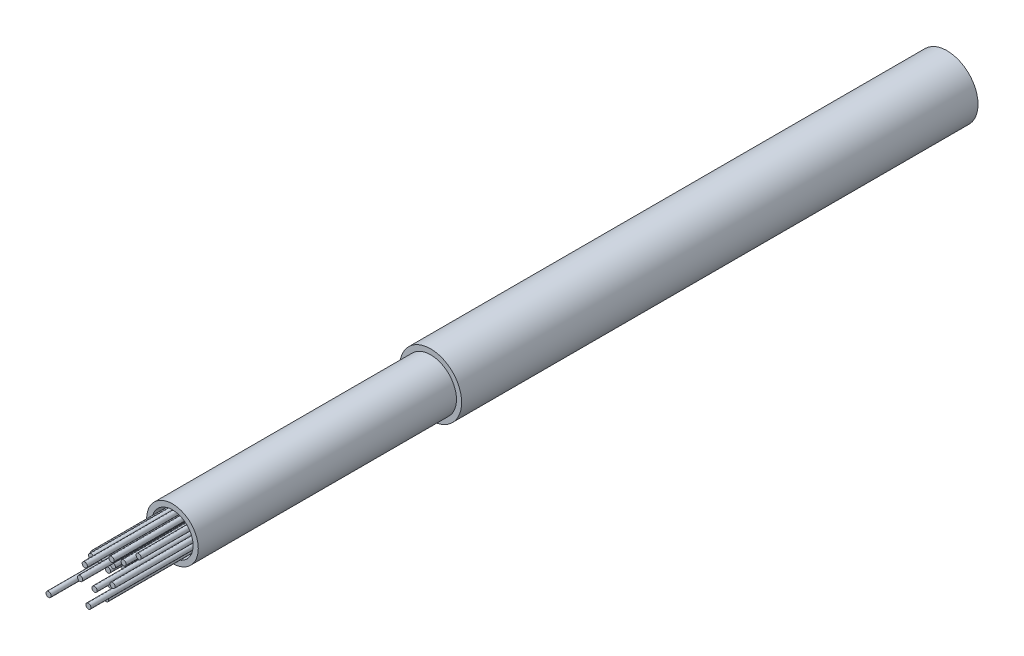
ISO-10303-21;
HEADER;
FILE_DESCRIPTION(('STEP AP214'),'2;1');
FILE_NAME('part.step','',(''),(''),'','','');
FILE_SCHEMA(('AUTOMOTIVE_DESIGN { 1 0 10303 214 1 1 1 1 }'));
ENDSEC;
DATA;
#1=APPLICATION_CONTEXT('core data for automotive mechanical design processes');
#2=APPLICATION_PROTOCOL_DEFINITION('international standard','automotive_design',2000,#1);
#3=PRODUCT_CONTEXT('',#1,'mechanical');
#4=PRODUCT('Part','Part','',(#3));
#5=PRODUCT_RELATED_PRODUCT_CATEGORY('part','',(#4));
#6=PRODUCT_DEFINITION_FORMATION('','',#4);
#7=PRODUCT_DEFINITION_CONTEXT('part definition',#1,'design');
#8=PRODUCT_DEFINITION('design','',#6,#7);
#9=PRODUCT_DEFINITION_SHAPE('','',#8);
#10=(LENGTH_UNIT() NAMED_UNIT(*) SI_UNIT(.MILLI.,.METRE.));
#11=(NAMED_UNIT(*) PLANE_ANGLE_UNIT() SI_UNIT($,.RADIAN.));
#12=(NAMED_UNIT(*) SI_UNIT($,.STERADIAN.) SOLID_ANGLE_UNIT());
#13=UNCERTAINTY_MEASURE_WITH_UNIT(LENGTH_MEASURE(1.E-05),#10,'distance_accuracy_value','');
#14=(GEOMETRIC_REPRESENTATION_CONTEXT(3) GLOBAL_UNCERTAINTY_ASSIGNED_CONTEXT((#13)) GLOBAL_UNIT_ASSIGNED_CONTEXT((#10,
#11,#12)) REPRESENTATION_CONTEXT('',''));
#15=CARTESIAN_POINT('',(0.,0.,0.));
#16=DIRECTION('',(0.,0.,1.));
#17=DIRECTION('',(1.,0.,0.));
#18=AXIS2_PLACEMENT_3D('',#15,#16,#17);
#19=CARTESIAN_POINT('',(12.4859510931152,5.46482605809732,85.4642796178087));
#20=DIRECTION('',(0.,0.,-1.));
#21=DIRECTION('',(-1.,0.,0.));
#22=AXIS2_PLACEMENT_3D('',#19,#20,#21);
#23=CYLINDRICAL_SURFACE('',#22,0.254000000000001);
#24=CARTESIAN_POINT('',(12.4859510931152,5.46482605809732,85.4642796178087));
#25=DIRECTION('',(0.,0.,1.));
#26=DIRECTION('',(1.,0.,0.));
#27=AXIS2_PLACEMENT_3D('',#24,#25,#26);
#28=CIRCLE('',#27,0.254000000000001);
#29=CARTESIAN_POINT('',(12.7399510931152,5.46482605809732,85.4642796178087));
#30=VERTEX_POINT('',#29);
#31=EDGE_CURVE('P0_E10',#30,#30,#28,.T.);
#32=ORIENTED_EDGE('',*,*,#31,.F.);
#33=EDGE_LOOP('',(#32));
#34=FACE_BOUND('',#33,.T.);
#35=CARTESIAN_POINT('',(12.4859510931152,5.46482605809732,34.6642796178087));
#36=DIRECTION('',(0.,0.,1.));
#37=DIRECTION('',(1.,0.,0.));
#38=AXIS2_PLACEMENT_3D('',#35,#36,#37);
#39=CIRCLE('',#38,0.254000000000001);
#40=CARTESIAN_POINT('',(12.7399510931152,5.46482605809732,34.6642796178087));
#41=VERTEX_POINT('',#40);
#42=EDGE_CURVE('P0_E17',#41,#41,#39,.T.);
#43=ORIENTED_EDGE('',*,*,#42,.T.);
#44=EDGE_LOOP('',(#43));
#45=FACE_BOUND('',#44,.T.);
#46=ADVANCED_FACE('P0_F14',(#34,#45),#23,.T.);
#47=CARTESIAN_POINT('',(12.4859510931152,5.46482605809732,85.4642796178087));
#48=DIRECTION('',(0.,0.,1.));
#49=DIRECTION('',(1.,0.,0.));
#50=AXIS2_PLACEMENT_3D('',#47,#48,#49);
#51=PLANE('',#50);
#52=ORIENTED_EDGE('',*,*,#31,.T.);
#53=EDGE_LOOP('',(#52));
#54=FACE_BOUND('',#53,.T.);
#55=ADVANCED_FACE('P0_F29',(#54),#51,.T.);
#56=CARTESIAN_POINT('',(12.4859510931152,5.46482605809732,34.6642796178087));
#57=DIRECTION('',(0.,0.,1.));
#58=DIRECTION('',(1.,0.,0.));
#59=AXIS2_PLACEMENT_3D('',#56,#57,#58);
#60=PLANE('',#59);
#61=ORIENTED_EDGE('',*,*,#42,.F.);
#62=EDGE_LOOP('',(#61));
#63=FACE_BOUND('',#62,.T.);
#64=ADVANCED_FACE('P0_F27',(#63),#60,.F.);
#65=CLOSED_SHELL('',(#46,#55,#64));
#66=MANIFOLD_SOLID_BREP('P0_B1',#65);
#67=CARTESIAN_POINT('',(10.9367534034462,6.18195374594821,81.5129893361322));
#68=DIRECTION('',(0.,0.,-1.));
#69=DIRECTION('',(-1.,0.,0.));
#70=AXIS2_PLACEMENT_3D('',#67,#68,#69);
#71=CYLINDRICAL_SURFACE('',#70,0.254000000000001);
#72=CARTESIAN_POINT('',(10.9367534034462,6.18195374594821,81.5129893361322));
#73=DIRECTION('',(0.,0.,1.));
#74=DIRECTION('',(1.,0.,0.));
#75=AXIS2_PLACEMENT_3D('',#72,#73,#74);
#76=CIRCLE('',#75,0.254000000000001);
#77=CARTESIAN_POINT('',(11.1907534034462,6.18195374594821,81.5129893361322));
#78=VERTEX_POINT('',#77);
#79=EDGE_CURVE('P1_E10',#78,#78,#76,.T.);
#80=ORIENTED_EDGE('',*,*,#79,.F.);
#81=EDGE_LOOP('',(#80));
#82=FACE_BOUND('',#81,.T.);
#83=CARTESIAN_POINT('',(10.9367534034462,6.18195374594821,30.7129893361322));
#84=DIRECTION('',(0.,0.,1.));
#85=DIRECTION('',(1.,0.,0.));
#86=AXIS2_PLACEMENT_3D('',#83,#84,#85);
#87=CIRCLE('',#86,0.254000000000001);
#88=CARTESIAN_POINT('',(11.1907534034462,6.18195374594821,30.7129893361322));
#89=VERTEX_POINT('',#88);
#90=EDGE_CURVE('P1_E17',#89,#89,#87,.T.);
#91=ORIENTED_EDGE('',*,*,#90,.T.);
#92=EDGE_LOOP('',(#91));
#93=FACE_BOUND('',#92,.T.);
#94=ADVANCED_FACE('P1_F14',(#82,#93),#71,.T.);
#95=CARTESIAN_POINT('',(10.9367534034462,6.18195374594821,81.5129893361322));
#96=DIRECTION('',(0.,0.,1.));
#97=DIRECTION('',(1.,0.,0.));
#98=AXIS2_PLACEMENT_3D('',#95,#96,#97);
#99=PLANE('',#98);
#100=ORIENTED_EDGE('',*,*,#79,.T.);
#101=EDGE_LOOP('',(#100));
#102=FACE_BOUND('',#101,.T.);
#103=ADVANCED_FACE('P1_F29',(#102),#99,.T.);
#104=CARTESIAN_POINT('',(10.9367534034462,6.18195374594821,30.7129893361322));
#105=DIRECTION('',(0.,0.,1.));
#106=DIRECTION('',(1.,0.,0.));
#107=AXIS2_PLACEMENT_3D('',#104,#105,#106);
#108=PLANE('',#107);
#109=ORIENTED_EDGE('',*,*,#90,.F.);
#110=EDGE_LOOP('',(#109));
#111=FACE_BOUND('',#110,.T.);
#112=ADVANCED_FACE('P1_F27',(#111),#108,.F.);
#113=CLOSED_SHELL('',(#94,#103,#112));
#114=MANIFOLD_SOLID_BREP('P1_B1',#113);
#115=CARTESIAN_POINT('',(11.1663042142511,6.91034505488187,84.9608276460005));
#116=DIRECTION('',(0.,0.,-1.));
#117=DIRECTION('',(-1.,0.,0.));
#118=AXIS2_PLACEMENT_3D('',#115,#116,#117);
#119=CYLINDRICAL_SURFACE('',#118,0.254000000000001);
#120=CARTESIAN_POINT('',(11.1663042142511,6.91034505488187,84.9608276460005));
#121=DIRECTION('',(0.,0.,1.));
#122=DIRECTION('',(1.,0.,0.));
#123=AXIS2_PLACEMENT_3D('',#120,#121,#122);
#124=CIRCLE('',#123,0.254000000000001);
#125=CARTESIAN_POINT('',(11.4203042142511,6.91034505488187,84.9608276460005));
#126=VERTEX_POINT('',#125);
#127=EDGE_CURVE('P2_E10',#126,#126,#124,.T.);
#128=ORIENTED_EDGE('',*,*,#127,.F.);
#129=EDGE_LOOP('',(#128));
#130=FACE_BOUND('',#129,.T.);
#131=CARTESIAN_POINT('',(11.1663042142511,6.91034505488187,34.1608276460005));
#132=DIRECTION('',(0.,0.,1.));
#133=DIRECTION('',(1.,0.,0.));
#134=AXIS2_PLACEMENT_3D('',#131,#132,#133);
#135=CIRCLE('',#134,0.254000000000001);
#136=CARTESIAN_POINT('',(11.4203042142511,6.91034505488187,34.1608276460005));
#137=VERTEX_POINT('',#136);
#138=EDGE_CURVE('P2_E17',#137,#137,#135,.T.);
#139=ORIENTED_EDGE('',*,*,#138,.T.);
#140=EDGE_LOOP('',(#139));
#141=FACE_BOUND('',#140,.T.);
#142=ADVANCED_FACE('P2_F14',(#130,#141),#119,.T.);
#143=CARTESIAN_POINT('',(11.1663042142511,6.91034505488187,84.9608276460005));
#144=DIRECTION('',(0.,0.,1.));
#145=DIRECTION('',(1.,0.,0.));
#146=AXIS2_PLACEMENT_3D('',#143,#144,#145);
#147=PLANE('',#146);
#148=ORIENTED_EDGE('',*,*,#127,.T.);
#149=EDGE_LOOP('',(#148));
#150=FACE_BOUND('',#149,.T.);
#151=ADVANCED_FACE('P2_F29',(#150),#147,.T.);
#152=CARTESIAN_POINT('',(11.1663042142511,6.91034505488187,34.1608276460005));
#153=DIRECTION('',(0.,0.,1.));
#154=DIRECTION('',(1.,0.,0.));
#155=AXIS2_PLACEMENT_3D('',#152,#153,#154);
#156=PLANE('',#155);
#157=ORIENTED_EDGE('',*,*,#138,.F.);
#158=EDGE_LOOP('',(#157));
#159=FACE_BOUND('',#158,.T.);
#160=ADVANCED_FACE('P2_F27',(#159),#156,.F.);
#161=CLOSED_SHELL('',(#142,#151,#160));
#162=MANIFOLD_SOLID_BREP('P2_B1',#161);
#163=CARTESIAN_POINT('',(11.2274149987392,5.64844669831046,68.6372111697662));
#164=DIRECTION('',(0.,0.,-1.));
#165=DIRECTION('',(-1.,0.,0.));
#166=AXIS2_PLACEMENT_3D('',#163,#164,#165);
#167=CYLINDRICAL_SURFACE('',#166,0.254000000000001);
#168=CARTESIAN_POINT('',(11.2274149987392,5.64844669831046,68.6372111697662));
#169=DIRECTION('',(0.,0.,1.));
#170=DIRECTION('',(1.,0.,0.));
#171=AXIS2_PLACEMENT_3D('',#168,#169,#170);
#172=CIRCLE('',#171,0.254000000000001);
#173=CARTESIAN_POINT('',(11.4814149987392,5.64844669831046,68.6372111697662));
#174=VERTEX_POINT('',#173);
#175=EDGE_CURVE('P3_E10',#174,#174,#172,.T.);
#176=ORIENTED_EDGE('',*,*,#175,.F.);
#177=EDGE_LOOP('',(#176));
#178=FACE_BOUND('',#177,.T.);
#179=CARTESIAN_POINT('',(11.2274149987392,5.64844669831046,17.8372111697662));
#180=DIRECTION('',(0.,0.,1.));
#181=DIRECTION('',(1.,0.,0.));
#182=AXIS2_PLACEMENT_3D('',#179,#180,#181);
#183=CIRCLE('',#182,0.254000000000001);
#184=CARTESIAN_POINT('',(11.4814149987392,5.64844669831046,17.8372111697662));
#185=VERTEX_POINT('',#184);
#186=EDGE_CURVE('P3_E17',#185,#185,#183,.T.);
#187=ORIENTED_EDGE('',*,*,#186,.T.);
#188=EDGE_LOOP('',(#187));
#189=FACE_BOUND('',#188,.T.);
#190=ADVANCED_FACE('P3_F14',(#178,#189),#167,.T.);
#191=CARTESIAN_POINT('',(11.2274149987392,5.64844669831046,68.6372111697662));
#192=DIRECTION('',(0.,0.,1.));
#193=DIRECTION('',(1.,0.,0.));
#194=AXIS2_PLACEMENT_3D('',#191,#192,#193);
#195=PLANE('',#194);
#196=ORIENTED_EDGE('',*,*,#175,.T.);
#197=EDGE_LOOP('',(#196));
#198=FACE_BOUND('',#197,.T.);
#199=ADVANCED_FACE('P3_F29',(#198),#195,.T.);
#200=CARTESIAN_POINT('',(11.2274149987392,5.64844669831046,17.8372111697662));
#201=DIRECTION('',(0.,0.,1.));
#202=DIRECTION('',(1.,0.,0.));
#203=AXIS2_PLACEMENT_3D('',#200,#201,#202);
#204=PLANE('',#203);
#205=ORIENTED_EDGE('',*,*,#186,.F.);
#206=EDGE_LOOP('',(#205));
#207=FACE_BOUND('',#206,.T.);
#208=ADVANCED_FACE('P3_F27',(#207),#204,.F.);
#209=CLOSED_SHELL('',(#190,#199,#208));
#210=MANIFOLD_SOLID_BREP('P3_B1',#209);
#211=CARTESIAN_POINT('',(9.56319362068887,6.76365951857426,82.0601210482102));
#212=DIRECTION('',(0.,0.,-1.));
#213=DIRECTION('',(-1.,0.,0.));
#214=AXIS2_PLACEMENT_3D('',#211,#212,#213);
#215=CYLINDRICAL_SURFACE('',#214,0.254000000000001);
#216=CARTESIAN_POINT('',(9.56319362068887,6.76365951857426,82.0601210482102));
#217=DIRECTION('',(0.,0.,1.));
#218=DIRECTION('',(1.,0.,0.));
#219=AXIS2_PLACEMENT_3D('',#216,#217,#218);
#220=CIRCLE('',#219,0.254000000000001);
#221=CARTESIAN_POINT('',(9.81719362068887,6.76365951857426,82.0601210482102));
#222=VERTEX_POINT('',#221);
#223=EDGE_CURVE('P4_E10',#222,#222,#220,.T.);
#224=ORIENTED_EDGE('',*,*,#223,.F.);
#225=EDGE_LOOP('',(#224));
#226=FACE_BOUND('',#225,.T.);
#227=CARTESIAN_POINT('',(9.56319362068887,6.76365951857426,31.2601210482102));
#228=DIRECTION('',(0.,0.,1.));
#229=DIRECTION('',(1.,0.,0.));
#230=AXIS2_PLACEMENT_3D('',#227,#228,#229);
#231=CIRCLE('',#230,0.254000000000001);
#232=CARTESIAN_POINT('',(9.81719362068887,6.76365951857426,31.2601210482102));
#233=VERTEX_POINT('',#232);
#234=EDGE_CURVE('P4_E17',#233,#233,#231,.T.);
#235=ORIENTED_EDGE('',*,*,#234,.T.);
#236=EDGE_LOOP('',(#235));
#237=FACE_BOUND('',#236,.T.);
#238=ADVANCED_FACE('P4_F14',(#226,#237),#215,.T.);
#239=CARTESIAN_POINT('',(9.56319362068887,6.76365951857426,82.0601210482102));
#240=DIRECTION('',(0.,0.,1.));
#241=DIRECTION('',(1.,0.,0.));
#242=AXIS2_PLACEMENT_3D('',#239,#240,#241);
#243=PLANE('',#242);
#244=ORIENTED_EDGE('',*,*,#223,.T.);
#245=EDGE_LOOP('',(#244));
#246=FACE_BOUND('',#245,.T.);
#247=ADVANCED_FACE('P4_F29',(#246),#243,.T.);
#248=CARTESIAN_POINT('',(9.56319362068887,6.76365951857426,31.2601210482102));
#249=DIRECTION('',(0.,0.,1.));
#250=DIRECTION('',(1.,0.,0.));
#251=AXIS2_PLACEMENT_3D('',#248,#249,#250);
#252=PLANE('',#251);
#253=ORIENTED_EDGE('',*,*,#234,.F.);
#254=EDGE_LOOP('',(#253));
#255=FACE_BOUND('',#254,.T.);
#256=ADVANCED_FACE('P4_F27',(#255),#252,.F.);
#257=CLOSED_SHELL('',(#238,#247,#256));
#258=MANIFOLD_SOLID_BREP('P4_B1',#257);
#259=CARTESIAN_POINT('',(10.3791667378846,5.03331315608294,50.3289535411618));
#260=DIRECTION('',(0.,0.,-1.));
#261=DIRECTION('',(-1.,0.,0.));
#262=AXIS2_PLACEMENT_3D('',#259,#260,#261);
#263=CYLINDRICAL_SURFACE('',#262,0.254000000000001);
#264=CARTESIAN_POINT('',(10.3791667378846,5.03331315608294,50.3289535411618));
#265=DIRECTION('',(0.,0.,1.));
#266=DIRECTION('',(1.,0.,0.));
#267=AXIS2_PLACEMENT_3D('',#264,#265,#266);
#268=CIRCLE('',#267,0.254000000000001);
#269=CARTESIAN_POINT('',(10.6331667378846,5.03331315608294,50.3289535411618));
#270=VERTEX_POINT('',#269);
#271=EDGE_CURVE('P5_E10',#270,#270,#268,.T.);
#272=ORIENTED_EDGE('',*,*,#271,.F.);
#273=EDGE_LOOP('',(#272));
#274=FACE_BOUND('',#273,.T.);
#275=CARTESIAN_POINT('',(10.3791667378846,5.03331315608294,-0.471046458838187));
#276=DIRECTION('',(0.,0.,1.));
#277=DIRECTION('',(1.,0.,0.));
#278=AXIS2_PLACEMENT_3D('',#275,#276,#277);
#279=CIRCLE('',#278,0.254000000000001);
#280=CARTESIAN_POINT('',(10.6331667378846,5.03331315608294,-0.471046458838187));
#281=VERTEX_POINT('',#280);
#282=EDGE_CURVE('P5_E17',#281,#281,#279,.T.);
#283=ORIENTED_EDGE('',*,*,#282,.T.);
#284=EDGE_LOOP('',(#283));
#285=FACE_BOUND('',#284,.T.);
#286=ADVANCED_FACE('P5_F14',(#274,#285),#263,.T.);
#287=CARTESIAN_POINT('',(10.3791667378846,5.03331315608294,50.3289535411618));
#288=DIRECTION('',(0.,0.,1.));
#289=DIRECTION('',(1.,0.,0.));
#290=AXIS2_PLACEMENT_3D('',#287,#288,#289);
#291=PLANE('',#290);
#292=ORIENTED_EDGE('',*,*,#271,.T.);
#293=EDGE_LOOP('',(#292));
#294=FACE_BOUND('',#293,.T.);
#295=ADVANCED_FACE('P5_F29',(#294),#291,.T.);
#296=CARTESIAN_POINT('',(10.3791667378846,5.03331315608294,-0.471046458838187));
#297=DIRECTION('',(0.,0.,1.));
#298=DIRECTION('',(1.,0.,0.));
#299=AXIS2_PLACEMENT_3D('',#296,#297,#298);
#300=PLANE('',#299);
#301=ORIENTED_EDGE('',*,*,#282,.F.);
#302=EDGE_LOOP('',(#301));
#303=FACE_BOUND('',#302,.T.);
#304=ADVANCED_FACE('P5_F27',(#303),#300,.F.);
#305=CLOSED_SHELL('',(#286,#295,#304));
#306=MANIFOLD_SOLID_BREP('P5_B1',#305);
#307=CARTESIAN_POINT('',(10.8743096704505,5.89577903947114,50.181404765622));
#308=DIRECTION('',(0.,0.,1.));
#309=DIRECTION('',(1.,0.,0.));
#310=AXIS2_PLACEMENT_3D('',#307,#308,#309);
#311=PLANE('',#310);
#312=CARTESIAN_POINT('',(10.8743096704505,5.89577903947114,50.181404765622));
#313=DIRECTION('',(0.,0.,1.));
#314=DIRECTION('',(1.,0.,0.));
#315=AXIS2_PLACEMENT_3D('',#312,#313,#314);
#316=CIRCLE('',#315,3.048);
#317=CARTESIAN_POINT('',(13.9223096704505,5.89577903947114,50.181404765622));
#318=VERTEX_POINT('',#317);
#319=EDGE_CURVE('P6_E10',#318,#318,#316,.T.);
#320=ORIENTED_EDGE('',*,*,#319,.T.);
#321=EDGE_LOOP('',(#320));
#322=FACE_BOUND('',#321,.T.);
#323=CARTESIAN_POINT('',(10.8743096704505,5.89577903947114,50.181404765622));
#324=DIRECTION('',(0.,0.,1.));
#325=DIRECTION('',(1.,0.,0.));
#326=AXIS2_PLACEMENT_3D('',#323,#324,#325);
#327=CIRCLE('',#326,2.54);
#328=CARTESIAN_POINT('',(13.4143096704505,5.89577903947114,50.181404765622));
#329=VERTEX_POINT('',#328);
#330=EDGE_CURVE('P6_E27',#329,#329,#327,.T.);
#331=ORIENTED_EDGE('',*,*,#330,.F.);
#332=EDGE_LOOP('',(#331));
#333=FACE_BOUND('',#332,.T.);
#334=ADVANCED_FACE('P6_F14',(#322,#333),#311,.T.);
#335=CARTESIAN_POINT('',(10.8743096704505,5.89577903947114,50.181404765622));
#336=DIRECTION('',(0.,0.,-1.));
#337=DIRECTION('',(-1.,0.,0.));
#338=AXIS2_PLACEMENT_3D('',#335,#336,#337);
#339=CYLINDRICAL_SURFACE('',#338,3.048);
#340=ORIENTED_EDGE('',*,*,#319,.F.);
#341=EDGE_LOOP('',(#340));
#342=FACE_BOUND('',#341,.T.);
#343=CARTESIAN_POINT('',(10.8743096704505,5.89577903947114,-0.61859523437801));
#344=DIRECTION('',(0.,0.,1.));
#345=DIRECTION('',(1.,0.,0.));
#346=AXIS2_PLACEMENT_3D('',#343,#344,#345);
#347=CIRCLE('',#346,3.048);
#348=CARTESIAN_POINT('',(13.9223096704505,5.89577903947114,-0.61859523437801));
#349=VERTEX_POINT('',#348);
#350=EDGE_CURVE('P6_E18',#349,#349,#347,.T.);
#351=ORIENTED_EDGE('',*,*,#350,.T.);
#352=EDGE_LOOP('',(#351));
#353=FACE_BOUND('',#352,.T.);
#354=ADVANCED_FACE('P6_F16',(#342,#353),#339,.T.);
#355=CARTESIAN_POINT('',(10.8743096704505,5.89577903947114,-0.61859523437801));
#356=DIRECTION('',(0.,0.,1.));
#357=DIRECTION('',(1.,0.,0.));
#358=AXIS2_PLACEMENT_3D('',#355,#356,#357);
#359=PLANE('',#358);
#360=ORIENTED_EDGE('',*,*,#350,.F.);
#361=EDGE_LOOP('',(#360));
#362=FACE_BOUND('',#361,.T.);
#363=ADVANCED_FACE('P6_F56',(#362),#359,.F.);
#364=CARTESIAN_POINT('',(10.8743096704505,5.89577903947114,75.581404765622));
#365=DIRECTION('',(0.,0.,-1.));
#366=DIRECTION('',(-1.,0.,0.));
#367=AXIS2_PLACEMENT_3D('',#364,#365,#366);
#368=CYLINDRICAL_SURFACE('',#367,2.54);
#369=CARTESIAN_POINT('',(10.8743096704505,5.89577903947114,75.581404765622));
#370=DIRECTION('',(0.,0.,1.));
#371=DIRECTION('',(1.,0.,0.));
#372=AXIS2_PLACEMENT_3D('',#369,#370,#371);
#373=CIRCLE('',#372,2.54);
#374=CARTESIAN_POINT('',(13.4143096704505,5.89577903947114,75.581404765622));
#375=VERTEX_POINT('',#374);
#376=EDGE_CURVE('P6_E25',#375,#375,#373,.T.);
#377=ORIENTED_EDGE('',*,*,#376,.F.);
#378=EDGE_LOOP('',(#377));
#379=FACE_BOUND('',#378,.T.);
#380=ORIENTED_EDGE('',*,*,#330,.T.);
#381=EDGE_LOOP('',(#380));
#382=FACE_BOUND('',#381,.T.);
#383=ADVANCED_FACE('P6_F50',(#379,#382),#368,.T.);
#384=CARTESIAN_POINT('',(10.8743096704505,5.89577903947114,75.581404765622));
#385=DIRECTION('',(0.,0.,1.));
#386=DIRECTION('',(1.,0.,0.));
#387=AXIS2_PLACEMENT_3D('',#384,#385,#386);
#388=PLANE('',#387);
#389=CARTESIAN_POINT('',(10.8743096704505,5.89577903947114,75.581404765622));
#390=DIRECTION('',(0.,0.,1.));
#391=DIRECTION('',(1.,0.,0.));
#392=AXIS2_PLACEMENT_3D('',#389,#390,#391);
#393=CIRCLE('',#392,2.032);
#394=CARTESIAN_POINT('',(12.9063096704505,5.89577903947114,75.581404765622));
#395=VERTEX_POINT('',#394);
#396=EDGE_CURVE('P6_E33',#395,#395,#393,.T.);
#397=ORIENTED_EDGE('',*,*,#396,.F.);
#398=EDGE_LOOP('',(#397));
#399=FACE_BOUND('',#398,.T.);
#400=ORIENTED_EDGE('',*,*,#376,.T.);
#401=EDGE_LOOP('',(#400));
#402=FACE_BOUND('',#401,.T.);
#403=ADVANCED_FACE('P6_F44',(#399,#402),#388,.T.);
#404=CARTESIAN_POINT('',(10.8743096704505,5.89577903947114,24.781404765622));
#405=DIRECTION('',(0.,0.,1.));
#406=DIRECTION('',(1.,0.,0.));
#407=AXIS2_PLACEMENT_3D('',#404,#405,#406);
#408=CYLINDRICAL_SURFACE('',#407,2.032);
#409=CARTESIAN_POINT('',(10.8743096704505,5.89577903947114,24.781404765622));
#410=DIRECTION('',(0.,0.,1.));
#411=DIRECTION('',(1.,0.,0.));
#412=AXIS2_PLACEMENT_3D('',#409,#410,#411);
#413=CIRCLE('',#412,2.032);
#414=CARTESIAN_POINT('',(12.9063096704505,5.89577903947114,24.781404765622));
#415=VERTEX_POINT('',#414);
#416=EDGE_CURVE('P6_E30',#415,#415,#413,.T.);
#417=ORIENTED_EDGE('',*,*,#416,.F.);
#418=EDGE_LOOP('',(#417));
#419=FACE_BOUND('',#418,.T.);
#420=ORIENTED_EDGE('',*,*,#396,.T.);
#421=EDGE_LOOP('',(#420));
#422=FACE_BOUND('',#421,.T.);
#423=ADVANCED_FACE('P6_F41',(#419,#422),#408,.F.);
#424=CARTESIAN_POINT('',(10.8743096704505,5.89577903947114,24.781404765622));
#425=DIRECTION('',(0.,0.,1.));
#426=DIRECTION('',(1.,0.,0.));
#427=AXIS2_PLACEMENT_3D('',#424,#425,#426);
#428=PLANE('',#427);
#429=ORIENTED_EDGE('',*,*,#416,.T.);
#430=EDGE_LOOP('',(#429));
#431=FACE_BOUND('',#430,.T.);
#432=ADVANCED_FACE('P6_F39',(#431),#428,.T.);
#433=CLOSED_SHELL('',(#334,#354,#363,#383,#403,#423,#432));
#434=MANIFOLD_SOLID_BREP('P6_B1',#433);
#435=CARTESIAN_POINT('',(10.1129591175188,6.31036576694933,81.9412370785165));
#436=DIRECTION('',(0.,0.,-1.));
#437=DIRECTION('',(-1.,0.,0.));
#438=AXIS2_PLACEMENT_3D('',#435,#436,#437);
#439=CYLINDRICAL_SURFACE('',#438,0.254000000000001);
#440=CARTESIAN_POINT('',(10.1129591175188,6.31036576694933,81.9412370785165));
#441=DIRECTION('',(0.,0.,1.));
#442=DIRECTION('',(1.,0.,0.));
#443=AXIS2_PLACEMENT_3D('',#440,#441,#442);
#444=CIRCLE('',#443,0.254000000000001);
#445=CARTESIAN_POINT('',(10.3669591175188,6.31036576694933,81.9412370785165));
#446=VERTEX_POINT('',#445);
#447=EDGE_CURVE('P7_E10',#446,#446,#444,.T.);
#448=ORIENTED_EDGE('',*,*,#447,.F.);
#449=EDGE_LOOP('',(#448));
#450=FACE_BOUND('',#449,.T.);
#451=CARTESIAN_POINT('',(10.1129591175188,6.31036576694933,31.1412370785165));
#452=DIRECTION('',(0.,0.,1.));
#453=DIRECTION('',(1.,0.,0.));
#454=AXIS2_PLACEMENT_3D('',#451,#452,#453);
#455=CIRCLE('',#454,0.254000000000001);
#456=CARTESIAN_POINT('',(10.3669591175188,6.31036576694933,31.1412370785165));
#457=VERTEX_POINT('',#456);
#458=EDGE_CURVE('P7_E17',#457,#457,#455,.T.);
#459=ORIENTED_EDGE('',*,*,#458,.T.);
#460=EDGE_LOOP('',(#459));
#461=FACE_BOUND('',#460,.T.);
#462=ADVANCED_FACE('P7_F14',(#450,#461),#439,.T.);
#463=CARTESIAN_POINT('',(10.1129591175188,6.31036576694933,81.9412370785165));
#464=DIRECTION('',(0.,0.,1.));
#465=DIRECTION('',(1.,0.,0.));
#466=AXIS2_PLACEMENT_3D('',#463,#464,#465);
#467=PLANE('',#466);
#468=ORIENTED_EDGE('',*,*,#447,.T.);
#469=EDGE_LOOP('',(#468));
#470=FACE_BOUND('',#469,.T.);
#471=ADVANCED_FACE('P7_F29',(#470),#467,.T.);
#472=CARTESIAN_POINT('',(10.1129591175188,6.31036576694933,31.1412370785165));
#473=DIRECTION('',(0.,0.,1.));
#474=DIRECTION('',(1.,0.,0.));
#475=AXIS2_PLACEMENT_3D('',#472,#473,#474);
#476=PLANE('',#475);
#477=ORIENTED_EDGE('',*,*,#458,.F.);
#478=EDGE_LOOP('',(#477));
#479=FACE_BOUND('',#478,.T.);
#480=ADVANCED_FACE('P7_F27',(#479),#476,.F.);
#481=CLOSED_SHELL('',(#462,#471,#480));
#482=MANIFOLD_SOLID_BREP('P7_B1',#481);
#483=CARTESIAN_POINT('',(10.5347974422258,6.73247955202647,81.2547410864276));
#484=DIRECTION('',(0.,0.,-1.));
#485=DIRECTION('',(-1.,0.,0.));
#486=AXIS2_PLACEMENT_3D('',#483,#484,#485);
#487=CYLINDRICAL_SURFACE('',#486,0.254000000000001);
#488=CARTESIAN_POINT('',(10.5347974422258,6.73247955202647,81.2547410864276));
#489=DIRECTION('',(0.,0.,1.));
#490=DIRECTION('',(1.,0.,0.));
#491=AXIS2_PLACEMENT_3D('',#488,#489,#490);
#492=CIRCLE('',#491,0.254000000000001);
#493=CARTESIAN_POINT('',(10.7887974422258,6.73247955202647,81.2547410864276));
#494=VERTEX_POINT('',#493);
#495=EDGE_CURVE('P8_E10',#494,#494,#492,.T.);
#496=ORIENTED_EDGE('',*,*,#495,.F.);
#497=EDGE_LOOP('',(#496));
#498=FACE_BOUND('',#497,.T.);
#499=CARTESIAN_POINT('',(10.5347974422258,6.73247955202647,30.4547410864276));
#500=DIRECTION('',(0.,0.,1.));
#501=DIRECTION('',(1.,0.,0.));
#502=AXIS2_PLACEMENT_3D('',#499,#500,#501);
#503=CIRCLE('',#502,0.254000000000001);
#504=CARTESIAN_POINT('',(10.7887974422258,6.73247955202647,30.4547410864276));
#505=VERTEX_POINT('',#504);
#506=EDGE_CURVE('P8_E17',#505,#505,#503,.T.);
#507=ORIENTED_EDGE('',*,*,#506,.T.);
#508=EDGE_LOOP('',(#507));
#509=FACE_BOUND('',#508,.T.);
#510=ADVANCED_FACE('P8_F14',(#498,#509),#487,.T.);
#511=CARTESIAN_POINT('',(10.5347974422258,6.73247955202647,81.2547410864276));
#512=DIRECTION('',(0.,0.,1.));
#513=DIRECTION('',(1.,0.,0.));
#514=AXIS2_PLACEMENT_3D('',#511,#512,#513);
#515=PLANE('',#514);
#516=ORIENTED_EDGE('',*,*,#495,.T.);
#517=EDGE_LOOP('',(#516));
#518=FACE_BOUND('',#517,.T.);
#519=ADVANCED_FACE('P8_F29',(#518),#515,.T.);
#520=CARTESIAN_POINT('',(10.5347974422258,6.73247955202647,30.4547410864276));
#521=DIRECTION('',(0.,0.,1.));
#522=DIRECTION('',(1.,0.,0.));
#523=AXIS2_PLACEMENT_3D('',#520,#521,#522);
#524=PLANE('',#523);
#525=ORIENTED_EDGE('',*,*,#506,.F.);
#526=EDGE_LOOP('',(#525));
#527=FACE_BOUND('',#526,.T.);
#528=ADVANCED_FACE('P8_F27',(#527),#524,.F.);
#529=CLOSED_SHELL('',(#510,#519,#528));
#530=MANIFOLD_SOLID_BREP('P8_B1',#529);
#531=CARTESIAN_POINT('',(10.5515178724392,5.64599425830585,81.6053310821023));
#532=DIRECTION('',(0.,0.,-1.));
#533=DIRECTION('',(-1.,0.,0.));
#534=AXIS2_PLACEMENT_3D('',#531,#532,#533);
#535=CYLINDRICAL_SURFACE('',#534,0.254000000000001);
#536=CARTESIAN_POINT('',(10.5515178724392,5.64599425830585,81.6053310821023));
#537=DIRECTION('',(0.,0.,1.));
#538=DIRECTION('',(1.,0.,0.));
#539=AXIS2_PLACEMENT_3D('',#536,#537,#538);
#540=CIRCLE('',#539,0.254000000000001);
#541=CARTESIAN_POINT('',(10.8055178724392,5.64599425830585,81.6053310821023));
#542=VERTEX_POINT('',#541);
#543=EDGE_CURVE('P9_E10',#542,#542,#540,.T.);
#544=ORIENTED_EDGE('',*,*,#543,.F.);
#545=EDGE_LOOP('',(#544));
#546=FACE_BOUND('',#545,.T.);
#547=CARTESIAN_POINT('',(10.5515178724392,5.64599425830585,30.8053310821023));
#548=DIRECTION('',(0.,0.,1.));
#549=DIRECTION('',(1.,0.,0.));
#550=AXIS2_PLACEMENT_3D('',#547,#548,#549);
#551=CIRCLE('',#550,0.254000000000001);
#552=CARTESIAN_POINT('',(10.8055178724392,5.64599425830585,30.8053310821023));
#553=VERTEX_POINT('',#552);
#554=EDGE_CURVE('P9_E17',#553,#553,#551,.T.);
#555=ORIENTED_EDGE('',*,*,#554,.T.);
#556=EDGE_LOOP('',(#555));
#557=FACE_BOUND('',#556,.T.);
#558=ADVANCED_FACE('P9_F14',(#546,#557),#535,.T.);
#559=CARTESIAN_POINT('',(10.5515178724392,5.64599425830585,81.6053310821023));
#560=DIRECTION('',(0.,0.,1.));
#561=DIRECTION('',(1.,0.,0.));
#562=AXIS2_PLACEMENT_3D('',#559,#560,#561);
#563=PLANE('',#562);
#564=ORIENTED_EDGE('',*,*,#543,.T.);
#565=EDGE_LOOP('',(#564));
#566=FACE_BOUND('',#565,.T.);
#567=ADVANCED_FACE('P9_F29',(#566),#563,.T.);
#568=CARTESIAN_POINT('',(10.5515178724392,5.64599425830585,30.8053310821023));
#569=DIRECTION('',(0.,0.,1.));
#570=DIRECTION('',(1.,0.,0.));
#571=AXIS2_PLACEMENT_3D('',#568,#569,#570);
#572=PLANE('',#571);
#573=ORIENTED_EDGE('',*,*,#554,.F.);
#574=EDGE_LOOP('',(#573));
#575=FACE_BOUND('',#574,.T.);
#576=ADVANCED_FACE('P9_F27',(#575),#572,.F.);
#577=CLOSED_SHELL('',(#558,#567,#576));
#578=MANIFOLD_SOLID_BREP('P9_B1',#577);
#579=CARTESIAN_POINT('',(11.6324856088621,7.47408630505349,82.3367500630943));
#580=DIRECTION('',(0.,0.,-1.));
#581=DIRECTION('',(-1.,0.,0.));
#582=AXIS2_PLACEMENT_3D('',#579,#580,#581);
#583=CYLINDRICAL_SURFACE('',#582,0.254000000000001);
#584=CARTESIAN_POINT('',(11.6324856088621,7.47408630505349,82.3367500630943));
#585=DIRECTION('',(0.,0.,1.));
#586=DIRECTION('',(1.,0.,0.));
#587=AXIS2_PLACEMENT_3D('',#584,#585,#586);
#588=CIRCLE('',#587,0.254000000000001);
#589=CARTESIAN_POINT('',(11.8864856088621,7.47408630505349,82.3367500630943));
#590=VERTEX_POINT('',#589);
#591=EDGE_CURVE('P10_E10',#590,#590,#588,.T.);
#592=ORIENTED_EDGE('',*,*,#591,.F.);
#593=EDGE_LOOP('',(#592));
#594=FACE_BOUND('',#593,.T.);
#595=CARTESIAN_POINT('',(11.6324856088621,7.47408630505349,31.5367500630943));
#596=DIRECTION('',(0.,0.,1.));
#597=DIRECTION('',(1.,0.,0.));
#598=AXIS2_PLACEMENT_3D('',#595,#596,#597);
#599=CIRCLE('',#598,0.254000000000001);
#600=CARTESIAN_POINT('',(11.8864856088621,7.47408630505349,31.5367500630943));
#601=VERTEX_POINT('',#600);
#602=EDGE_CURVE('P10_E17',#601,#601,#599,.T.);
#603=ORIENTED_EDGE('',*,*,#602,.T.);
#604=EDGE_LOOP('',(#603));
#605=FACE_BOUND('',#604,.T.);
#606=ADVANCED_FACE('P10_F14',(#594,#605),#583,.T.);
#607=CARTESIAN_POINT('',(11.6324856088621,7.47408630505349,82.3367500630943));
#608=DIRECTION('',(0.,0.,1.));
#609=DIRECTION('',(1.,0.,0.));
#610=AXIS2_PLACEMENT_3D('',#607,#608,#609);
#611=PLANE('',#610);
#612=ORIENTED_EDGE('',*,*,#591,.T.);
#613=EDGE_LOOP('',(#612));
#614=FACE_BOUND('',#613,.T.);
#615=ADVANCED_FACE('P10_F29',(#614),#611,.T.);
#616=CARTESIAN_POINT('',(11.6324856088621,7.47408630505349,31.5367500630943));
#617=DIRECTION('',(0.,0.,1.));
#618=DIRECTION('',(1.,0.,0.));
#619=AXIS2_PLACEMENT_3D('',#616,#617,#618);
#620=PLANE('',#619);
#621=ORIENTED_EDGE('',*,*,#602,.F.);
#622=EDGE_LOOP('',(#621));
#623=FACE_BOUND('',#622,.T.);
#624=ADVANCED_FACE('P10_F27',(#623),#620,.F.);
#625=CLOSED_SHELL('',(#606,#615,#624));
#626=MANIFOLD_SOLID_BREP('P10_B1',#625);
#627=CARTESIAN_POINT('',(9.40023979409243,5.33199810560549,86.2937508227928));
#628=DIRECTION('',(0.,0.,-1.));
#629=DIRECTION('',(-1.,0.,0.));
#630=AXIS2_PLACEMENT_3D('',#627,#628,#629);
#631=CYLINDRICAL_SURFACE('',#630,0.254000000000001);
#632=CARTESIAN_POINT('',(9.40023979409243,5.33199810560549,86.2937508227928));
#633=DIRECTION('',(0.,0.,1.));
#634=DIRECTION('',(1.,0.,0.));
#635=AXIS2_PLACEMENT_3D('',#632,#633,#634);
#636=CIRCLE('',#635,0.254000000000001);
#637=CARTESIAN_POINT('',(9.65423979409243,5.33199810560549,86.2937508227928));
#638=VERTEX_POINT('',#637);
#639=EDGE_CURVE('P11_E10',#638,#638,#636,.T.);
#640=ORIENTED_EDGE('',*,*,#639,.F.);
#641=EDGE_LOOP('',(#640));
#642=FACE_BOUND('',#641,.T.);
#643=CARTESIAN_POINT('',(9.40023979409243,5.33199810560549,35.4937508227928));
#644=DIRECTION('',(0.,0.,1.));
#645=DIRECTION('',(1.,0.,0.));
#646=AXIS2_PLACEMENT_3D('',#643,#644,#645);
#647=CIRCLE('',#646,0.254000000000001);
#648=CARTESIAN_POINT('',(9.65423979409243,5.33199810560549,35.4937508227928));
#649=VERTEX_POINT('',#648);
#650=EDGE_CURVE('P11_E17',#649,#649,#647,.T.);
#651=ORIENTED_EDGE('',*,*,#650,.T.);
#652=EDGE_LOOP('',(#651));
#653=FACE_BOUND('',#652,.T.);
#654=ADVANCED_FACE('P11_F14',(#642,#653),#631,.T.);
#655=CARTESIAN_POINT('',(9.40023979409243,5.33199810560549,86.2937508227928));
#656=DIRECTION('',(0.,0.,1.));
#657=DIRECTION('',(1.,0.,0.));
#658=AXIS2_PLACEMENT_3D('',#655,#656,#657);
#659=PLANE('',#658);
#660=ORIENTED_EDGE('',*,*,#639,.T.);
#661=EDGE_LOOP('',(#660));
#662=FACE_BOUND('',#661,.T.);
#663=ADVANCED_FACE('P11_F29',(#662),#659,.T.);
#664=CARTESIAN_POINT('',(9.40023979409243,5.33199810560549,35.4937508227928));
#665=DIRECTION('',(0.,0.,1.));
#666=DIRECTION('',(1.,0.,0.));
#667=AXIS2_PLACEMENT_3D('',#664,#665,#666);
#668=PLANE('',#667);
#669=ORIENTED_EDGE('',*,*,#650,.F.);
#670=EDGE_LOOP('',(#669));
#671=FACE_BOUND('',#670,.T.);
#672=ADVANCED_FACE('P11_F27',(#671),#668,.F.);
#673=CLOSED_SHELL('',(#654,#663,#672));
#674=MANIFOLD_SOLID_BREP('P11_B1',#673);
#675=CARTESIAN_POINT('',(9.40990209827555,6.10977830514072,82.1562397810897));
#676=DIRECTION('',(0.,0.,-1.));
#677=DIRECTION('',(-1.,0.,0.));
#678=AXIS2_PLACEMENT_3D('',#675,#676,#677);
#679=CYLINDRICAL_SURFACE('',#678,0.254000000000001);
#680=CARTESIAN_POINT('',(9.40990209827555,6.10977830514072,82.1562397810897));
#681=DIRECTION('',(0.,0.,1.));
#682=DIRECTION('',(1.,0.,0.));
#683=AXIS2_PLACEMENT_3D('',#680,#681,#682);
#684=CIRCLE('',#683,0.254000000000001);
#685=CARTESIAN_POINT('',(9.66390209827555,6.10977830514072,82.1562397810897));
#686=VERTEX_POINT('',#685);
#687=EDGE_CURVE('P12_E10',#686,#686,#684,.T.);
#688=ORIENTED_EDGE('',*,*,#687,.F.);
#689=EDGE_LOOP('',(#688));
#690=FACE_BOUND('',#689,.T.);
#691=CARTESIAN_POINT('',(9.40990209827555,6.10977830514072,31.3562397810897));
#692=DIRECTION('',(0.,0.,1.));
#693=DIRECTION('',(1.,0.,0.));
#694=AXIS2_PLACEMENT_3D('',#691,#692,#693);
#695=CIRCLE('',#694,0.254000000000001);
#696=CARTESIAN_POINT('',(9.66390209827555,6.10977830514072,31.3562397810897));
#697=VERTEX_POINT('',#696);
#698=EDGE_CURVE('P12_E17',#697,#697,#695,.T.);
#699=ORIENTED_EDGE('',*,*,#698,.T.);
#700=EDGE_LOOP('',(#699));
#701=FACE_BOUND('',#700,.T.);
#702=ADVANCED_FACE('P12_F14',(#690,#701),#679,.T.);
#703=CARTESIAN_POINT('',(9.40990209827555,6.10977830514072,82.1562397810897));
#704=DIRECTION('',(0.,0.,1.));
#705=DIRECTION('',(1.,0.,0.));
#706=AXIS2_PLACEMENT_3D('',#703,#704,#705);
#707=PLANE('',#706);
#708=ORIENTED_EDGE('',*,*,#687,.T.);
#709=EDGE_LOOP('',(#708));
#710=FACE_BOUND('',#709,.T.);
#711=ADVANCED_FACE('P12_F29',(#710),#707,.T.);
#712=CARTESIAN_POINT('',(9.40990209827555,6.10977830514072,31.3562397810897));
#713=DIRECTION('',(0.,0.,1.));
#714=DIRECTION('',(1.,0.,0.));
#715=AXIS2_PLACEMENT_3D('',#712,#713,#714);
#716=PLANE('',#715);
#717=ORIENTED_EDGE('',*,*,#698,.F.);
#718=EDGE_LOOP('',(#717));
#719=FACE_BOUND('',#718,.T.);
#720=ADVANCED_FACE('P12_F27',(#719),#716,.F.);
#721=CLOSED_SHELL('',(#702,#711,#720));
#722=MANIFOLD_SOLID_BREP('P12_B1',#721);
#723=CARTESIAN_POINT('',(9.8694835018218,4.59745118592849,79.5093180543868));
#724=DIRECTION('',(0.,0.,-1.));
#725=DIRECTION('',(-1.,0.,0.));
#726=AXIS2_PLACEMENT_3D('',#723,#724,#725);
#727=CYLINDRICAL_SURFACE('',#726,0.254000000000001);
#728=CARTESIAN_POINT('',(9.8694835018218,4.59745118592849,79.5093180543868));
#729=DIRECTION('',(0.,0.,1.));
#730=DIRECTION('',(1.,0.,0.));
#731=AXIS2_PLACEMENT_3D('',#728,#729,#730);
#732=CIRCLE('',#731,0.254000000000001);
#733=CARTESIAN_POINT('',(10.1234835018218,4.59745118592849,79.5093180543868));
#734=VERTEX_POINT('',#733);
#735=EDGE_CURVE('P13_E10',#734,#734,#732,.T.);
#736=ORIENTED_EDGE('',*,*,#735,.F.);
#737=EDGE_LOOP('',(#736));
#738=FACE_BOUND('',#737,.T.);
#739=CARTESIAN_POINT('',(9.8694835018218,4.59745118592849,28.7093180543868));
#740=DIRECTION('',(0.,0.,1.));
#741=DIRECTION('',(1.,0.,0.));
#742=AXIS2_PLACEMENT_3D('',#739,#740,#741);
#743=CIRCLE('',#742,0.254000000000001);
#744=CARTESIAN_POINT('',(10.1234835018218,4.59745118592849,28.7093180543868));
#745=VERTEX_POINT('',#744);
#746=EDGE_CURVE('P13_E17',#745,#745,#743,.T.);
#747=ORIENTED_EDGE('',*,*,#746,.T.);
#748=EDGE_LOOP('',(#747));
#749=FACE_BOUND('',#748,.T.);
#750=ADVANCED_FACE('P13_F14',(#738,#749),#727,.T.);
#751=CARTESIAN_POINT('',(9.8694835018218,4.59745118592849,79.5093180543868));
#752=DIRECTION('',(0.,0.,1.));
#753=DIRECTION('',(1.,0.,0.));
#754=AXIS2_PLACEMENT_3D('',#751,#752,#753);
#755=PLANE('',#754);
#756=ORIENTED_EDGE('',*,*,#735,.T.);
#757=EDGE_LOOP('',(#756));
#758=FACE_BOUND('',#757,.T.);
#759=ADVANCED_FACE('P13_F29',(#758),#755,.T.);
#760=CARTESIAN_POINT('',(9.8694835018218,4.59745118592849,28.7093180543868));
#761=DIRECTION('',(0.,0.,1.));
#762=DIRECTION('',(1.,0.,0.));
#763=AXIS2_PLACEMENT_3D('',#760,#761,#762);
#764=PLANE('',#763);
#765=ORIENTED_EDGE('',*,*,#746,.F.);
#766=EDGE_LOOP('',(#765));
#767=FACE_BOUND('',#766,.T.);
#768=ADVANCED_FACE('P13_F27',(#767),#764,.F.);
#769=CLOSED_SHELL('',(#750,#759,#768));
#770=MANIFOLD_SOLID_BREP('P13_B1',#769);
#771=CARTESIAN_POINT('',(11.6085647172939,4.40431164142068,80.3967053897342));
#772=DIRECTION('',(0.,0.,-1.));
#773=DIRECTION('',(-1.,0.,0.));
#774=AXIS2_PLACEMENT_3D('',#771,#772,#773);
#775=CYLINDRICAL_SURFACE('',#774,0.254000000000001);
#776=CARTESIAN_POINT('',(11.6085647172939,4.40431164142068,80.3967053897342));
#777=DIRECTION('',(0.,0.,1.));
#778=DIRECTION('',(1.,0.,0.));
#779=AXIS2_PLACEMENT_3D('',#776,#777,#778);
#780=CIRCLE('',#779,0.254000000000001);
#781=CARTESIAN_POINT('',(11.8625647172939,4.40431164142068,80.3967053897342));
#782=VERTEX_POINT('',#781);
#783=EDGE_CURVE('P14_E10',#782,#782,#780,.T.);
#784=ORIENTED_EDGE('',*,*,#783,.F.);
#785=EDGE_LOOP('',(#784));
#786=FACE_BOUND('',#785,.T.);
#787=CARTESIAN_POINT('',(11.6085647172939,4.40431164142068,29.5967053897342));
#788=DIRECTION('',(0.,0.,1.));
#789=DIRECTION('',(1.,0.,0.));
#790=AXIS2_PLACEMENT_3D('',#787,#788,#789);
#791=CIRCLE('',#790,0.254000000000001);
#792=CARTESIAN_POINT('',(11.8625647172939,4.40431164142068,29.5967053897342));
#793=VERTEX_POINT('',#792);
#794=EDGE_CURVE('P14_E17',#793,#793,#791,.T.);
#795=ORIENTED_EDGE('',*,*,#794,.T.);
#796=EDGE_LOOP('',(#795));
#797=FACE_BOUND('',#796,.T.);
#798=ADVANCED_FACE('P14_F14',(#786,#797),#775,.T.);
#799=CARTESIAN_POINT('',(11.6085647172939,4.40431164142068,80.3967053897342));
#800=DIRECTION('',(0.,0.,1.));
#801=DIRECTION('',(1.,0.,0.));
#802=AXIS2_PLACEMENT_3D('',#799,#800,#801);
#803=PLANE('',#802);
#804=ORIENTED_EDGE('',*,*,#783,.T.);
#805=EDGE_LOOP('',(#804));
#806=FACE_BOUND('',#805,.T.);
#807=ADVANCED_FACE('P14_F29',(#806),#803,.T.);
#808=CARTESIAN_POINT('',(11.6085647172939,4.40431164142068,29.5967053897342));
#809=DIRECTION('',(0.,0.,1.));
#810=DIRECTION('',(1.,0.,0.));
#811=AXIS2_PLACEMENT_3D('',#808,#809,#810);
#812=PLANE('',#811);
#813=ORIENTED_EDGE('',*,*,#794,.F.);
#814=EDGE_LOOP('',(#813));
#815=FACE_BOUND('',#814,.T.);
#816=ADVANCED_FACE('P14_F27',(#815),#812,.F.);
#817=CLOSED_SHELL('',(#798,#807,#816));
#818=MANIFOLD_SOLID_BREP('P14_B1',#817);
#819=CARTESIAN_POINT('',(11.5253619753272,6.46141816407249,81.0352829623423));
#820=DIRECTION('',(0.,0.,-1.));
#821=DIRECTION('',(-1.,0.,0.));
#822=AXIS2_PLACEMENT_3D('',#819,#820,#821);
#823=CYLINDRICAL_SURFACE('',#822,0.254000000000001);
#824=CARTESIAN_POINT('',(11.5253619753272,6.46141816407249,81.0352829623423));
#825=DIRECTION('',(0.,0.,1.));
#826=DIRECTION('',(1.,0.,0.));
#827=AXIS2_PLACEMENT_3D('',#824,#825,#826);
#828=CIRCLE('',#827,0.254000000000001);
#829=CARTESIAN_POINT('',(11.7793619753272,6.46141816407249,81.0352829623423));
#830=VERTEX_POINT('',#829);
#831=EDGE_CURVE('P15_E10',#830,#830,#828,.T.);
#832=ORIENTED_EDGE('',*,*,#831,.F.);
#833=EDGE_LOOP('',(#832));
#834=FACE_BOUND('',#833,.T.);
#835=CARTESIAN_POINT('',(11.5253619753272,6.46141816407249,30.2352829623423));
#836=DIRECTION('',(0.,0.,1.));
#837=DIRECTION('',(1.,0.,0.));
#838=AXIS2_PLACEMENT_3D('',#835,#836,#837);
#839=CIRCLE('',#838,0.254000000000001);
#840=CARTESIAN_POINT('',(11.7793619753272,6.46141816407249,30.2352829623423));
#841=VERTEX_POINT('',#840);
#842=EDGE_CURVE('P15_E17',#841,#841,#839,.T.);
#843=ORIENTED_EDGE('',*,*,#842,.T.);
#844=EDGE_LOOP('',(#843));
#845=FACE_BOUND('',#844,.T.);
#846=ADVANCED_FACE('P15_F14',(#834,#845),#823,.T.);
#847=CARTESIAN_POINT('',(11.5253619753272,6.46141816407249,81.0352829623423));
#848=DIRECTION('',(0.,0.,1.));
#849=DIRECTION('',(1.,0.,0.));
#850=AXIS2_PLACEMENT_3D('',#847,#848,#849);
#851=PLANE('',#850);
#852=ORIENTED_EDGE('',*,*,#831,.T.);
#853=EDGE_LOOP('',(#852));
#854=FACE_BOUND('',#853,.T.);
#855=ADVANCED_FACE('P15_F29',(#854),#851,.T.);
#856=CARTESIAN_POINT('',(11.5253619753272,6.46141816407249,30.2352829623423));
#857=DIRECTION('',(0.,0.,1.));
#858=DIRECTION('',(1.,0.,0.));
#859=AXIS2_PLACEMENT_3D('',#856,#857,#858);
#860=PLANE('',#859);
#861=ORIENTED_EDGE('',*,*,#842,.F.);
#862=EDGE_LOOP('',(#861));
#863=FACE_BOUND('',#862,.T.);
#864=ADVANCED_FACE('P15_F27',(#863),#860,.F.);
#865=CLOSED_SHELL('',(#846,#855,#864));
#866=MANIFOLD_SOLID_BREP('P15_B1',#865);
#867=CARTESIAN_POINT('',(10.2095155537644,7.26993613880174,82.9160509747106));
#868=DIRECTION('',(0.,0.,-1.));
#869=DIRECTION('',(-1.,0.,0.));
#870=AXIS2_PLACEMENT_3D('',#867,#868,#869);
#871=CYLINDRICAL_SURFACE('',#870,0.254000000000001);
#872=CARTESIAN_POINT('',(10.2095155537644,7.26993613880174,82.9160509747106));
#873=DIRECTION('',(0.,0.,1.));
#874=DIRECTION('',(1.,0.,0.));
#875=AXIS2_PLACEMENT_3D('',#872,#873,#874);
#876=CIRCLE('',#875,0.254000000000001);
#877=CARTESIAN_POINT('',(10.4635155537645,7.26993613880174,82.9160509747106));
#878=VERTEX_POINT('',#877);
#879=EDGE_CURVE('P16_E10',#878,#878,#876,.T.);
#880=ORIENTED_EDGE('',*,*,#879,.F.);
#881=EDGE_LOOP('',(#880));
#882=FACE_BOUND('',#881,.T.);
#883=CARTESIAN_POINT('',(10.2095155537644,7.26993613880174,32.1160509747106));
#884=DIRECTION('',(0.,0.,1.));
#885=DIRECTION('',(1.,0.,0.));
#886=AXIS2_PLACEMENT_3D('',#883,#884,#885);
#887=CIRCLE('',#886,0.254000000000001);
#888=CARTESIAN_POINT('',(10.4635155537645,7.26993613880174,32.1160509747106));
#889=VERTEX_POINT('',#888);
#890=EDGE_CURVE('P16_E17',#889,#889,#887,.T.);
#891=ORIENTED_EDGE('',*,*,#890,.T.);
#892=EDGE_LOOP('',(#891));
#893=FACE_BOUND('',#892,.T.);
#894=ADVANCED_FACE('P16_F14',(#882,#893),#871,.T.);
#895=CARTESIAN_POINT('',(10.2095155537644,7.26993613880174,82.9160509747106));
#896=DIRECTION('',(0.,0.,1.));
#897=DIRECTION('',(1.,0.,0.));
#898=AXIS2_PLACEMENT_3D('',#895,#896,#897);
#899=PLANE('',#898);
#900=ORIENTED_EDGE('',*,*,#879,.T.);
#901=EDGE_LOOP('',(#900));
#902=FACE_BOUND('',#901,.T.);
#903=ADVANCED_FACE('P16_F29',(#902),#899,.T.);
#904=CARTESIAN_POINT('',(10.2095155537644,7.26993613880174,32.1160509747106));
#905=DIRECTION('',(0.,0.,1.));
#906=DIRECTION('',(1.,0.,0.));
#907=AXIS2_PLACEMENT_3D('',#904,#905,#906);
#908=PLANE('',#907);
#909=ORIENTED_EDGE('',*,*,#890,.F.);
#910=EDGE_LOOP('',(#909));
#911=FACE_BOUND('',#910,.T.);
#912=ADVANCED_FACE('P16_F27',(#911),#908,.F.);
#913=CLOSED_SHELL('',(#894,#903,#912));
#914=MANIFOLD_SOLID_BREP('P16_B1',#913);
#915=CARTESIAN_POINT('',(12.5256041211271,6.09122671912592,83.121175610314));
#916=DIRECTION('',(0.,0.,-1.));
#917=DIRECTION('',(-1.,0.,0.));
#918=AXIS2_PLACEMENT_3D('',#915,#916,#917);
#919=CYLINDRICAL_SURFACE('',#918,0.254000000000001);
#920=CARTESIAN_POINT('',(12.5256041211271,6.09122671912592,83.121175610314));
#921=DIRECTION('',(0.,0.,1.));
#922=DIRECTION('',(1.,0.,0.));
#923=AXIS2_PLACEMENT_3D('',#920,#921,#922);
#924=CIRCLE('',#923,0.254000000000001);
#925=CARTESIAN_POINT('',(12.7796041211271,6.09122671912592,83.121175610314));
#926=VERTEX_POINT('',#925);
#927=EDGE_CURVE('P17_E10',#926,#926,#924,.T.);
#928=ORIENTED_EDGE('',*,*,#927,.F.);
#929=EDGE_LOOP('',(#928));
#930=FACE_BOUND('',#929,.T.);
#931=CARTESIAN_POINT('',(12.5256041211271,6.09122671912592,32.321175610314));
#932=DIRECTION('',(0.,0.,1.));
#933=DIRECTION('',(1.,0.,0.));
#934=AXIS2_PLACEMENT_3D('',#931,#932,#933);
#935=CIRCLE('',#934,0.254000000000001);
#936=CARTESIAN_POINT('',(12.7796041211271,6.09122671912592,32.321175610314));
#937=VERTEX_POINT('',#936);
#938=EDGE_CURVE('P17_E17',#937,#937,#935,.T.);
#939=ORIENTED_EDGE('',*,*,#938,.T.);
#940=EDGE_LOOP('',(#939));
#941=FACE_BOUND('',#940,.T.);
#942=ADVANCED_FACE('P17_F14',(#930,#941),#919,.T.);
#943=CARTESIAN_POINT('',(12.5256041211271,6.09122671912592,83.121175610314));
#944=DIRECTION('',(0.,0.,1.));
#945=DIRECTION('',(1.,0.,0.));
#946=AXIS2_PLACEMENT_3D('',#943,#944,#945);
#947=PLANE('',#946);
#948=ORIENTED_EDGE('',*,*,#927,.T.);
#949=EDGE_LOOP('',(#948));
#950=FACE_BOUND('',#949,.T.);
#951=ADVANCED_FACE('P17_F29',(#950),#947,.T.);
#952=CARTESIAN_POINT('',(12.5256041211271,6.09122671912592,32.321175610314));
#953=DIRECTION('',(0.,0.,1.));
#954=DIRECTION('',(1.,0.,0.));
#955=AXIS2_PLACEMENT_3D('',#952,#953,#954);
#956=PLANE('',#955);
#957=ORIENTED_EDGE('',*,*,#938,.F.);
#958=EDGE_LOOP('',(#957));
#959=FACE_BOUND('',#958,.T.);
#960=ADVANCED_FACE('P17_F27',(#959),#956,.F.);
#961=CLOSED_SHELL('',(#942,#951,#960));
#962=MANIFOLD_SOLID_BREP('P17_B1',#961);
#963=CARTESIAN_POINT('',(12.2115910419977,4.95743316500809,83.4455375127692));
#964=DIRECTION('',(0.,0.,-1.));
#965=DIRECTION('',(-1.,0.,0.));
#966=AXIS2_PLACEMENT_3D('',#963,#964,#965);
#967=CYLINDRICAL_SURFACE('',#966,0.254000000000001);
#968=CARTESIAN_POINT('',(12.2115910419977,4.95743316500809,83.4455375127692));
#969=DIRECTION('',(0.,0.,1.));
#970=DIRECTION('',(1.,0.,0.));
#971=AXIS2_PLACEMENT_3D('',#968,#969,#970);
#972=CIRCLE('',#971,0.254000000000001);
#973=CARTESIAN_POINT('',(12.4655910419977,4.95743316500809,83.4455375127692));
#974=VERTEX_POINT('',#973);
#975=EDGE_CURVE('P18_E10',#974,#974,#972,.T.);
#976=ORIENTED_EDGE('',*,*,#975,.F.);
#977=EDGE_LOOP('',(#976));
#978=FACE_BOUND('',#977,.T.);
#979=CARTESIAN_POINT('',(12.2115910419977,4.95743316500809,32.6455375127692));
#980=DIRECTION('',(0.,0.,1.));
#981=DIRECTION('',(1.,0.,0.));
#982=AXIS2_PLACEMENT_3D('',#979,#980,#981);
#983=CIRCLE('',#982,0.254000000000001);
#984=CARTESIAN_POINT('',(12.4655910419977,4.95743316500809,32.6455375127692));
#985=VERTEX_POINT('',#984);
#986=EDGE_CURVE('P18_E17',#985,#985,#983,.T.);
#987=ORIENTED_EDGE('',*,*,#986,.T.);
#988=EDGE_LOOP('',(#987));
#989=FACE_BOUND('',#988,.T.);
#990=ADVANCED_FACE('P18_F14',(#978,#989),#967,.T.);
#991=CARTESIAN_POINT('',(12.2115910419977,4.95743316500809,83.4455375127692));
#992=DIRECTION('',(0.,0.,1.));
#993=DIRECTION('',(1.,0.,0.));
#994=AXIS2_PLACEMENT_3D('',#991,#992,#993);
#995=PLANE('',#994);
#996=ORIENTED_EDGE('',*,*,#975,.T.);
#997=EDGE_LOOP('',(#996));
#998=FACE_BOUND('',#997,.T.);
#999=ADVANCED_FACE('P18_F29',(#998),#995,.T.);
#1000=CARTESIAN_POINT('',(12.2115910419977,4.95743316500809,32.6455375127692));
#1001=DIRECTION('',(0.,0.,1.));
#1002=DIRECTION('',(1.,0.,0.));
#1003=AXIS2_PLACEMENT_3D('',#1000,#1001,#1002);
#1004=PLANE('',#1003);
#1005=ORIENTED_EDGE('',*,*,#986,.F.);
#1006=EDGE_LOOP('',(#1005));
#1007=FACE_BOUND('',#1006,.T.);
#1008=ADVANCED_FACE('P18_F27',(#1007),#1004,.F.);
#1009=CLOSED_SHELL('',(#990,#999,#1008));
#1010=MANIFOLD_SOLID_BREP('P18_B1',#1009);
#1011=CARTESIAN_POINT('',(12.1495926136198,6.88310538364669,80.1798812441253));
#1012=DIRECTION('',(0.,0.,-1.));
#1013=DIRECTION('',(-1.,0.,0.));
#1014=AXIS2_PLACEMENT_3D('',#1011,#1012,#1013);
#1015=CYLINDRICAL_SURFACE('',#1014,0.254000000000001);
#1016=CARTESIAN_POINT('',(12.1495926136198,6.88310538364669,80.1798812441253));
#1017=DIRECTION('',(0.,0.,1.));
#1018=DIRECTION('',(1.,0.,0.));
#1019=AXIS2_PLACEMENT_3D('',#1016,#1017,#1018);
#1020=CIRCLE('',#1019,0.254000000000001);
#1021=CARTESIAN_POINT('',(12.4035926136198,6.88310538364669,80.1798812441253));
#1022=VERTEX_POINT('',#1021);
#1023=EDGE_CURVE('P19_E10',#1022,#1022,#1020,.T.);
#1024=ORIENTED_EDGE('',*,*,#1023,.F.);
#1025=EDGE_LOOP('',(#1024));
#1026=FACE_BOUND('',#1025,.T.);
#1027=CARTESIAN_POINT('',(12.1495926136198,6.88310538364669,29.3798812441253));
#1028=DIRECTION('',(0.,0.,1.));
#1029=DIRECTION('',(1.,0.,0.));
#1030=AXIS2_PLACEMENT_3D('',#1027,#1028,#1029);
#1031=CIRCLE('',#1030,0.254000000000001);
#1032=CARTESIAN_POINT('',(12.4035926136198,6.88310538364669,29.3798812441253));
#1033=VERTEX_POINT('',#1032);
#1034=EDGE_CURVE('P19_E17',#1033,#1033,#1031,.T.);
#1035=ORIENTED_EDGE('',*,*,#1034,.T.);
#1036=EDGE_LOOP('',(#1035));
#1037=FACE_BOUND('',#1036,.T.);
#1038=ADVANCED_FACE('P19_F14',(#1026,#1037),#1015,.T.);
#1039=CARTESIAN_POINT('',(12.1495926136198,6.88310538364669,80.1798812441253));
#1040=DIRECTION('',(0.,0.,1.));
#1041=DIRECTION('',(1.,0.,0.));
#1042=AXIS2_PLACEMENT_3D('',#1039,#1040,#1041);
#1043=PLANE('',#1042);
#1044=ORIENTED_EDGE('',*,*,#1023,.T.);
#1045=EDGE_LOOP('',(#1044));
#1046=FACE_BOUND('',#1045,.T.);
#1047=ADVANCED_FACE('P19_F29',(#1046),#1043,.T.);
#1048=CARTESIAN_POINT('',(12.1495926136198,6.88310538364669,29.3798812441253));
#1049=DIRECTION('',(0.,0.,1.));
#1050=DIRECTION('',(1.,0.,0.));
#1051=AXIS2_PLACEMENT_3D('',#1048,#1049,#1050);
#1052=PLANE('',#1051);
#1053=ORIENTED_EDGE('',*,*,#1034,.F.);
#1054=EDGE_LOOP('',(#1053));
#1055=FACE_BOUND('',#1054,.T.);
#1056=ADVANCED_FACE('P19_F27',(#1055),#1052,.F.);
#1057=CLOSED_SHELL('',(#1038,#1047,#1056));
#1058=MANIFOLD_SOLID_BREP('P19_B1',#1057);
#1059=CARTESIAN_POINT('',(11.8066281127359,5.9330664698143,84.1870847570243));
#1060=DIRECTION('',(0.,0.,-1.));
#1061=DIRECTION('',(-1.,0.,0.));
#1062=AXIS2_PLACEMENT_3D('',#1059,#1060,#1061);
#1063=CYLINDRICAL_SURFACE('',#1062,0.254000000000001);
#1064=CARTESIAN_POINT('',(11.8066281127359,5.9330664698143,84.1870847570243));
#1065=DIRECTION('',(0.,0.,1.));
#1066=DIRECTION('',(1.,0.,0.));
#1067=AXIS2_PLACEMENT_3D('',#1064,#1065,#1066);
#1068=CIRCLE('',#1067,0.254000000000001);
#1069=CARTESIAN_POINT('',(12.0606281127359,5.9330664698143,84.1870847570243));
#1070=VERTEX_POINT('',#1069);
#1071=EDGE_CURVE('P20_E10',#1070,#1070,#1068,.T.);
#1072=ORIENTED_EDGE('',*,*,#1071,.F.);
#1073=EDGE_LOOP('',(#1072));
#1074=FACE_BOUND('',#1073,.T.);
#1075=CARTESIAN_POINT('',(11.8066281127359,5.9330664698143,33.3870847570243));
#1076=DIRECTION('',(0.,0.,1.));
#1077=DIRECTION('',(1.,0.,0.));
#1078=AXIS2_PLACEMENT_3D('',#1075,#1076,#1077);
#1079=CIRCLE('',#1078,0.254000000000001);
#1080=CARTESIAN_POINT('',(12.0606281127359,5.9330664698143,33.3870847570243));
#1081=VERTEX_POINT('',#1080);
#1082=EDGE_CURVE('P20_E17',#1081,#1081,#1079,.T.);
#1083=ORIENTED_EDGE('',*,*,#1082,.T.);
#1084=EDGE_LOOP('',(#1083));
#1085=FACE_BOUND('',#1084,.T.);
#1086=ADVANCED_FACE('P20_F14',(#1074,#1085),#1063,.T.);
#1087=CARTESIAN_POINT('',(11.8066281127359,5.9330664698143,84.1870847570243));
#1088=DIRECTION('',(0.,0.,1.));
#1089=DIRECTION('',(1.,0.,0.));
#1090=AXIS2_PLACEMENT_3D('',#1087,#1088,#1089);
#1091=PLANE('',#1090);
#1092=ORIENTED_EDGE('',*,*,#1071,.T.);
#1093=EDGE_LOOP('',(#1092));
#1094=FACE_BOUND('',#1093,.T.);
#1095=ADVANCED_FACE('P20_F29',(#1094),#1091,.T.);
#1096=CARTESIAN_POINT('',(11.8066281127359,5.9330664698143,33.3870847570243));
#1097=DIRECTION('',(0.,0.,1.));
#1098=DIRECTION('',(1.,0.,0.));
#1099=AXIS2_PLACEMENT_3D('',#1096,#1097,#1098);
#1100=PLANE('',#1099);
#1101=ORIENTED_EDGE('',*,*,#1082,.F.);
#1102=EDGE_LOOP('',(#1101));
#1103=FACE_BOUND('',#1102,.T.);
#1104=ADVANCED_FACE('P20_F27',(#1103),#1100,.F.);
#1105=CLOSED_SHELL('',(#1086,#1095,#1104));
#1106=MANIFOLD_SOLID_BREP('P20_B1',#1105);
#1107=CARTESIAN_POINT('',(11.5884321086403,5.21801624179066,55.5449947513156));
#1108=DIRECTION('',(0.,0.,-1.));
#1109=DIRECTION('',(-1.,0.,0.));
#1110=AXIS2_PLACEMENT_3D('',#1107,#1108,#1109);
#1111=CYLINDRICAL_SURFACE('',#1110,0.254000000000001);
#1112=CARTESIAN_POINT('',(11.5884321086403,5.21801624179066,55.5449947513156));
#1113=DIRECTION('',(0.,0.,1.));
#1114=DIRECTION('',(1.,0.,0.));
#1115=AXIS2_PLACEMENT_3D('',#1112,#1113,#1114);
#1116=CIRCLE('',#1115,0.254000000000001);
#1117=CARTESIAN_POINT('',(11.8424321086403,5.21801624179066,55.5449947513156));
#1118=VERTEX_POINT('',#1117);
#1119=EDGE_CURVE('P21_E10',#1118,#1118,#1116,.T.);
#1120=ORIENTED_EDGE('',*,*,#1119,.F.);
#1121=EDGE_LOOP('',(#1120));
#1122=FACE_BOUND('',#1121,.T.);
#1123=CARTESIAN_POINT('',(11.5884321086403,5.21801624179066,4.74499475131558));
#1124=DIRECTION('',(0.,0.,1.));
#1125=DIRECTION('',(1.,0.,0.));
#1126=AXIS2_PLACEMENT_3D('',#1123,#1124,#1125);
#1127=CIRCLE('',#1126,0.254000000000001);
#1128=CARTESIAN_POINT('',(11.8424321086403,5.21801624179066,4.74499475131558));
#1129=VERTEX_POINT('',#1128);
#1130=EDGE_CURVE('P21_E17',#1129,#1129,#1127,.T.);
#1131=ORIENTED_EDGE('',*,*,#1130,.T.);
#1132=EDGE_LOOP('',(#1131));
#1133=FACE_BOUND('',#1132,.T.);
#1134=ADVANCED_FACE('P21_F14',(#1122,#1133),#1111,.T.);
#1135=CARTESIAN_POINT('',(11.5884321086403,5.21801624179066,55.5449947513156));
#1136=DIRECTION('',(0.,0.,1.));
#1137=DIRECTION('',(1.,0.,0.));
#1138=AXIS2_PLACEMENT_3D('',#1135,#1136,#1137);
#1139=PLANE('',#1138);
#1140=ORIENTED_EDGE('',*,*,#1119,.T.);
#1141=EDGE_LOOP('',(#1140));
#1142=FACE_BOUND('',#1141,.T.);
#1143=ADVANCED_FACE('P21_F29',(#1142),#1139,.T.);
#1144=CARTESIAN_POINT('',(11.5884321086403,5.21801624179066,4.74499475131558));
#1145=DIRECTION('',(0.,0.,1.));
#1146=DIRECTION('',(1.,0.,0.));
#1147=AXIS2_PLACEMENT_3D('',#1144,#1145,#1146);
#1148=PLANE('',#1147);
#1149=ORIENTED_EDGE('',*,*,#1130,.F.);
#1150=EDGE_LOOP('',(#1149));
#1151=FACE_BOUND('',#1150,.T.);
#1152=ADVANCED_FACE('P21_F27',(#1151),#1148,.F.);
#1153=CLOSED_SHELL('',(#1134,#1143,#1152));
#1154=MANIFOLD_SOLID_BREP('P21_B1',#1153);
#1155=CARTESIAN_POINT('',(9.93698737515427,5.64320636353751,79.6949221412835));
#1156=DIRECTION('',(0.,0.,-1.));
#1157=DIRECTION('',(-1.,0.,0.));
#1158=AXIS2_PLACEMENT_3D('',#1155,#1156,#1157);
#1159=CYLINDRICAL_SURFACE('',#1158,0.254000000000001);
#1160=CARTESIAN_POINT('',(9.93698737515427,5.64320636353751,79.6949221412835));
#1161=DIRECTION('',(0.,0.,1.));
#1162=DIRECTION('',(1.,0.,0.));
#1163=AXIS2_PLACEMENT_3D('',#1160,#1161,#1162);
#1164=CIRCLE('',#1163,0.254000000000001);
#1165=CARTESIAN_POINT('',(10.1909873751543,5.64320636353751,79.6949221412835));
#1166=VERTEX_POINT('',#1165);
#1167=EDGE_CURVE('P22_E10',#1166,#1166,#1164,.T.);
#1168=ORIENTED_EDGE('',*,*,#1167,.F.);
#1169=EDGE_LOOP('',(#1168));
#1170=FACE_BOUND('',#1169,.T.);
#1171=CARTESIAN_POINT('',(9.93698737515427,5.64320636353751,28.8949221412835));
#1172=DIRECTION('',(0.,0.,1.));
#1173=DIRECTION('',(1.,0.,0.));
#1174=AXIS2_PLACEMENT_3D('',#1171,#1172,#1173);
#1175=CIRCLE('',#1174,0.254000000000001);
#1176=CARTESIAN_POINT('',(10.1909873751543,5.64320636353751,28.8949221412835));
#1177=VERTEX_POINT('',#1176);
#1178=EDGE_CURVE('P22_E17',#1177,#1177,#1175,.T.);
#1179=ORIENTED_EDGE('',*,*,#1178,.T.);
#1180=EDGE_LOOP('',(#1179));
#1181=FACE_BOUND('',#1180,.T.);
#1182=ADVANCED_FACE('P22_F14',(#1170,#1181),#1159,.T.);
#1183=CARTESIAN_POINT('',(9.93698737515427,5.64320636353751,79.6949221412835));
#1184=DIRECTION('',(0.,0.,1.));
#1185=DIRECTION('',(1.,0.,0.));
#1186=AXIS2_PLACEMENT_3D('',#1183,#1184,#1185);
#1187=PLANE('',#1186);
#1188=ORIENTED_EDGE('',*,*,#1167,.T.);
#1189=EDGE_LOOP('',(#1188));
#1190=FACE_BOUND('',#1189,.T.);
#1191=ADVANCED_FACE('P22_F29',(#1190),#1187,.T.);
#1192=CARTESIAN_POINT('',(9.93698737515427,5.64320636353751,28.8949221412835));
#1193=DIRECTION('',(0.,0.,1.));
#1194=DIRECTION('',(1.,0.,0.));
#1195=AXIS2_PLACEMENT_3D('',#1192,#1193,#1194);
#1196=PLANE('',#1195);
#1197=ORIENTED_EDGE('',*,*,#1178,.F.);
#1198=EDGE_LOOP('',(#1197));
#1199=FACE_BOUND('',#1198,.T.);
#1200=ADVANCED_FACE('P22_F27',(#1199),#1196,.F.);
#1201=CLOSED_SHELL('',(#1182,#1191,#1200));
#1202=MANIFOLD_SOLID_BREP('P22_B1',#1201);
#1203=CARTESIAN_POINT('',(10.8729829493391,7.54545507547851,84.209017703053));
#1204=DIRECTION('',(0.,0.,-1.));
#1205=DIRECTION('',(-1.,0.,0.));
#1206=AXIS2_PLACEMENT_3D('',#1203,#1204,#1205);
#1207=CYLINDRICAL_SURFACE('',#1206,0.254000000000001);
#1208=CARTESIAN_POINT('',(10.8729829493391,7.54545507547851,84.209017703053));
#1209=DIRECTION('',(0.,0.,1.));
#1210=DIRECTION('',(1.,0.,0.));
#1211=AXIS2_PLACEMENT_3D('',#1208,#1209,#1210);
#1212=CIRCLE('',#1211,0.254000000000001);
#1213=CARTESIAN_POINT('',(11.1269829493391,7.54545507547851,84.209017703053));
#1214=VERTEX_POINT('',#1213);
#1215=EDGE_CURVE('P23_E10',#1214,#1214,#1212,.T.);
#1216=ORIENTED_EDGE('',*,*,#1215,.F.);
#1217=EDGE_LOOP('',(#1216));
#1218=FACE_BOUND('',#1217,.T.);
#1219=CARTESIAN_POINT('',(10.8729829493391,7.54545507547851,33.409017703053));
#1220=DIRECTION('',(0.,0.,1.));
#1221=DIRECTION('',(1.,0.,0.));
#1222=AXIS2_PLACEMENT_3D('',#1219,#1220,#1221);
#1223=CIRCLE('',#1222,0.254000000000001);
#1224=CARTESIAN_POINT('',(11.1269829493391,7.54545507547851,33.409017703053));
#1225=VERTEX_POINT('',#1224);
#1226=EDGE_CURVE('P23_E17',#1225,#1225,#1223,.T.);
#1227=ORIENTED_EDGE('',*,*,#1226,.T.);
#1228=EDGE_LOOP('',(#1227));
#1229=FACE_BOUND('',#1228,.T.);
#1230=ADVANCED_FACE('P23_F14',(#1218,#1229),#1207,.T.);
#1231=CARTESIAN_POINT('',(10.8729829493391,7.54545507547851,84.209017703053));
#1232=DIRECTION('',(0.,0.,1.));
#1233=DIRECTION('',(1.,0.,0.));
#1234=AXIS2_PLACEMENT_3D('',#1231,#1232,#1233);
#1235=PLANE('',#1234);
#1236=ORIENTED_EDGE('',*,*,#1215,.T.);
#1237=EDGE_LOOP('',(#1236));
#1238=FACE_BOUND('',#1237,.T.);
#1239=ADVANCED_FACE('P23_F29',(#1238),#1235,.T.);
#1240=CARTESIAN_POINT('',(10.8729829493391,7.54545507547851,33.409017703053));
#1241=DIRECTION('',(0.,0.,1.));
#1242=DIRECTION('',(1.,0.,0.));
#1243=AXIS2_PLACEMENT_3D('',#1240,#1241,#1242);
#1244=PLANE('',#1243);
#1245=ORIENTED_EDGE('',*,*,#1226,.F.);
#1246=EDGE_LOOP('',(#1245));
#1247=FACE_BOUND('',#1246,.T.);
#1248=ADVANCED_FACE('P23_F27',(#1247),#1244,.F.);
#1249=CLOSED_SHELL('',(#1230,#1239,#1248));
#1250=MANIFOLD_SOLID_BREP('P23_B1',#1249);
#1251=CARTESIAN_POINT('',(11.055041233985,4.87780482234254,80.9226220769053));
#1252=DIRECTION('',(0.,0.,-1.));
#1253=DIRECTION('',(-1.,0.,0.));
#1254=AXIS2_PLACEMENT_3D('',#1251,#1252,#1253);
#1255=CYLINDRICAL_SURFACE('',#1254,0.254000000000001);
#1256=CARTESIAN_POINT('',(11.055041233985,4.87780482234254,80.9226220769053));
#1257=DIRECTION('',(0.,0.,1.));
#1258=DIRECTION('',(1.,0.,0.));
#1259=AXIS2_PLACEMENT_3D('',#1256,#1257,#1258);
#1260=CIRCLE('',#1259,0.254000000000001);
#1261=CARTESIAN_POINT('',(11.309041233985,4.87780482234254,80.9226220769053));
#1262=VERTEX_POINT('',#1261);
#1263=EDGE_CURVE('P24_E10',#1262,#1262,#1260,.T.);
#1264=ORIENTED_EDGE('',*,*,#1263,.F.);
#1265=EDGE_LOOP('',(#1264));
#1266=FACE_BOUND('',#1265,.T.);
#1267=CARTESIAN_POINT('',(11.055041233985,4.87780482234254,30.1226220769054));
#1268=DIRECTION('',(0.,0.,1.));
#1269=DIRECTION('',(1.,0.,0.));
#1270=AXIS2_PLACEMENT_3D('',#1267,#1268,#1269);
#1271=CIRCLE('',#1270,0.254000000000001);
#1272=CARTESIAN_POINT('',(11.309041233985,4.87780482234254,30.1226220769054));
#1273=VERTEX_POINT('',#1272);
#1274=EDGE_CURVE('P24_E17',#1273,#1273,#1271,.T.);
#1275=ORIENTED_EDGE('',*,*,#1274,.T.);
#1276=EDGE_LOOP('',(#1275));
#1277=FACE_BOUND('',#1276,.T.);
#1278=ADVANCED_FACE('P24_F14',(#1266,#1277),#1255,.T.);
#1279=CARTESIAN_POINT('',(11.055041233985,4.87780482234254,80.9226220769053));
#1280=DIRECTION('',(0.,0.,1.));
#1281=DIRECTION('',(1.,0.,0.));
#1282=AXIS2_PLACEMENT_3D('',#1279,#1280,#1281);
#1283=PLANE('',#1282);
#1284=ORIENTED_EDGE('',*,*,#1263,.T.);
#1285=EDGE_LOOP('',(#1284));
#1286=FACE_BOUND('',#1285,.T.);
#1287=ADVANCED_FACE('P24_F29',(#1286),#1283,.T.);
#1288=CARTESIAN_POINT('',(11.055041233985,4.87780482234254,30.1226220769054));
#1289=DIRECTION('',(0.,0.,1.));
#1290=DIRECTION('',(1.,0.,0.));
#1291=AXIS2_PLACEMENT_3D('',#1288,#1289,#1290);
#1292=PLANE('',#1291);
#1293=ORIENTED_EDGE('',*,*,#1274,.F.);
#1294=EDGE_LOOP('',(#1293));
#1295=FACE_BOUND('',#1294,.T.);
#1296=ADVANCED_FACE('P24_F27',(#1295),#1292,.F.);
#1297=CLOSED_SHELL('',(#1278,#1287,#1296));
#1298=MANIFOLD_SOLID_BREP('P24_B1',#1297);
#1299=CARTESIAN_POINT('',(10.5635905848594,4.28165338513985,81.4264515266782));
#1300=DIRECTION('',(0.,0.,-1.));
#1301=DIRECTION('',(-1.,0.,0.));
#1302=AXIS2_PLACEMENT_3D('',#1299,#1300,#1301);
#1303=CYLINDRICAL_SURFACE('',#1302,0.254000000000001);
#1304=CARTESIAN_POINT('',(10.5635905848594,4.28165338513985,81.4264515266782));
#1305=DIRECTION('',(0.,0.,1.));
#1306=DIRECTION('',(1.,0.,0.));
#1307=AXIS2_PLACEMENT_3D('',#1304,#1305,#1306);
#1308=CIRCLE('',#1307,0.254000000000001);
#1309=CARTESIAN_POINT('',(10.8175905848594,4.28165338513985,81.4264515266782));
#1310=VERTEX_POINT('',#1309);
#1311=EDGE_CURVE('P25_E10',#1310,#1310,#1308,.T.);
#1312=ORIENTED_EDGE('',*,*,#1311,.F.);
#1313=EDGE_LOOP('',(#1312));
#1314=FACE_BOUND('',#1313,.T.);
#1315=CARTESIAN_POINT('',(10.5635905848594,4.28165338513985,30.6264515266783));
#1316=DIRECTION('',(0.,0.,1.));
#1317=DIRECTION('',(1.,0.,0.));
#1318=AXIS2_PLACEMENT_3D('',#1315,#1316,#1317);
#1319=CIRCLE('',#1318,0.254000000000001);
#1320=CARTESIAN_POINT('',(10.8175905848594,4.28165338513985,30.6264515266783));
#1321=VERTEX_POINT('',#1320);
#1322=EDGE_CURVE('P25_E17',#1321,#1321,#1319,.T.);
#1323=ORIENTED_EDGE('',*,*,#1322,.T.);
#1324=EDGE_LOOP('',(#1323));
#1325=FACE_BOUND('',#1324,.T.);
#1326=ADVANCED_FACE('P25_F14',(#1314,#1325),#1303,.T.);
#1327=CARTESIAN_POINT('',(10.5635905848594,4.28165338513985,81.4264515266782));
#1328=DIRECTION('',(0.,0.,1.));
#1329=DIRECTION('',(1.,0.,0.));
#1330=AXIS2_PLACEMENT_3D('',#1327,#1328,#1329);
#1331=PLANE('',#1330);
#1332=ORIENTED_EDGE('',*,*,#1311,.T.);
#1333=EDGE_LOOP('',(#1332));
#1334=FACE_BOUND('',#1333,.T.);
#1335=ADVANCED_FACE('P25_F29',(#1334),#1331,.T.);
#1336=CARTESIAN_POINT('',(10.5635905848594,4.28165338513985,30.6264515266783));
#1337=DIRECTION('',(0.,0.,1.));
#1338=DIRECTION('',(1.,0.,0.));
#1339=AXIS2_PLACEMENT_3D('',#1336,#1337,#1338);
#1340=PLANE('',#1339);
#1341=ORIENTED_EDGE('',*,*,#1322,.F.);
#1342=EDGE_LOOP('',(#1341));
#1343=FACE_BOUND('',#1342,.T.);
#1344=ADVANCED_FACE('P25_F27',(#1343),#1340,.F.);
#1345=CLOSED_SHELL('',(#1326,#1335,#1344));
#1346=MANIFOLD_SOLID_BREP('P25_B1',#1345);
#1347=ADVANCED_BREP_SHAPE_REPRESENTATION('',(#18,#66,#114,#162,#210,#258,#306,#434,#482,#530,
#578,#626,#674,#722,#770,#818,#866,#914,#962,#1010,#1058,#1106,#1154,#1202,#1250,#1298,#1346),#14);
#1348=SHAPE_DEFINITION_REPRESENTATION(#9,#1347);
ENDSEC;
END-ISO-10303-21;
